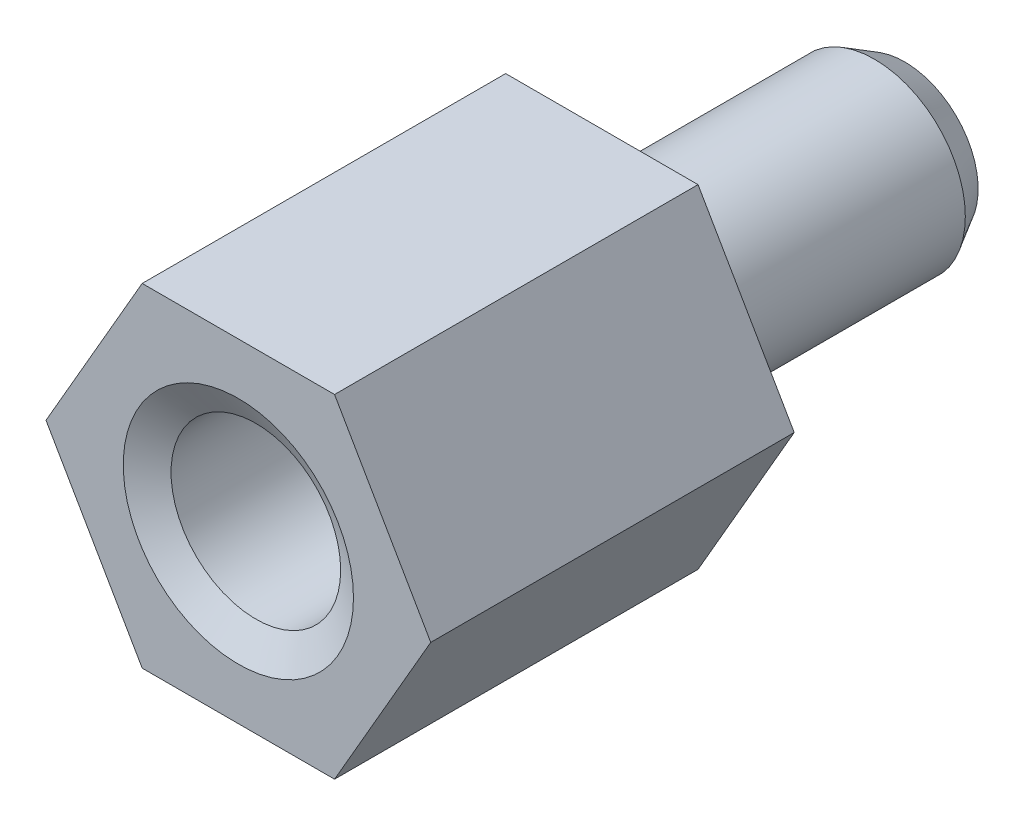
ISO-10303-21;
HEADER;
FILE_DESCRIPTION(('STEP AP214'),'2;1');
FILE_NAME('part.step','',(''),(''),'','','');
FILE_SCHEMA(('AUTOMOTIVE_DESIGN { 1 0 10303 214 1 1 1 1 }'));
ENDSEC;
DATA;
#1=APPLICATION_CONTEXT('core data for automotive mechanical design processes');
#2=APPLICATION_PROTOCOL_DEFINITION('international standard','automotive_design',2000,#1);
#3=PRODUCT_CONTEXT('',#1,'mechanical');
#4=PRODUCT('Part','Part','',(#3));
#5=PRODUCT_RELATED_PRODUCT_CATEGORY('part','',(#4));
#6=PRODUCT_DEFINITION_FORMATION('','',#4);
#7=PRODUCT_DEFINITION_CONTEXT('part definition',#1,'design');
#8=PRODUCT_DEFINITION('design','',#6,#7);
#9=PRODUCT_DEFINITION_SHAPE('','',#8);
#10=(LENGTH_UNIT() NAMED_UNIT(*) SI_UNIT(.MILLI.,.METRE.));
#11=(NAMED_UNIT(*) PLANE_ANGLE_UNIT() SI_UNIT($,.RADIAN.));
#12=(NAMED_UNIT(*) SI_UNIT($,.STERADIAN.) SOLID_ANGLE_UNIT());
#13=UNCERTAINTY_MEASURE_WITH_UNIT(LENGTH_MEASURE(1.E-05),#10,'distance_accuracy_value','');
#14=(GEOMETRIC_REPRESENTATION_CONTEXT(3) GLOBAL_UNCERTAINTY_ASSIGNED_CONTEXT((#13)) GLOBAL_UNIT_ASSIGNED_CONTEXT((#10,
#11,#12)) REPRESENTATION_CONTEXT('',''));
#15=CARTESIAN_POINT('',(0.,0.,0.));
#16=DIRECTION('',(0.,0.,1.));
#17=DIRECTION('',(1.,0.,0.));
#18=AXIS2_PLACEMENT_3D('',#15,#16,#17);
#19=CARTESIAN_POINT('',(3.17542648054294,0.,6.));
#20=DIRECTION('',(-0.866025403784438,-0.5,0.));
#21=DIRECTION('',(0.5,-0.866025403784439,0.));
#22=AXIS2_PLACEMENT_3D('',#19,#20,#21);
#23=PLANE('',#22);
#24=DIRECTION('',(-0.5,0.866025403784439,0.));
#25=VECTOR('',#24,1.);
#26=CARTESIAN_POINT('',(3.17542648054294,0.,0.));
#27=LINE('',#26,#25);
#28=CARTESIAN_POINT('',(3.17542648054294,0.,0.));
#29=VERTEX_POINT('',#28);
#30=CARTESIAN_POINT('',(1.58771324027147,2.75,0.));
#31=VERTEX_POINT('',#30);
#32=EDGE_CURVE('E132',#29,#31,#27,.T.);
#33=ORIENTED_EDGE('',*,*,#32,.T.);
#34=DIRECTION('',(0.,0.,-1.));
#35=VECTOR('',#34,1.);
#36=CARTESIAN_POINT('',(1.58771324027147,2.75,6.));
#37=LINE('',#36,#35);
#38=CARTESIAN_POINT('',(1.58771324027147,2.75,6.));
#39=VERTEX_POINT('',#38);
#40=EDGE_CURVE('E149',#39,#31,#37,.T.);
#41=ORIENTED_EDGE('',*,*,#40,.F.);
#42=DIRECTION('',(-0.5,0.866025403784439,0.));
#43=VECTOR('',#42,1.);
#44=CARTESIAN_POINT('',(3.17542648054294,0.,6.));
#45=LINE('',#44,#43);
#46=CARTESIAN_POINT('',(3.17542648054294,0.,6.));
#47=VERTEX_POINT('',#46);
#48=EDGE_CURVE('E142',#47,#39,#45,.T.);
#49=ORIENTED_EDGE('',*,*,#48,.F.);
#50=DIRECTION('',(0.,0.,-1.));
#51=VECTOR('',#50,1.);
#52=CARTESIAN_POINT('',(3.17542648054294,0.,6.));
#53=LINE('',#52,#51);
#54=EDGE_CURVE('E128',#47,#29,#53,.T.);
#55=ORIENTED_EDGE('',*,*,#54,.T.);
#56=EDGE_LOOP('',(#33,#41,#49,#55));
#57=FACE_BOUND('',#56,.T.);
#58=ADVANCED_FACE('F46',(#57),#23,.F.);
#59=CARTESIAN_POINT('',(1.58771324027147,2.75,6.));
#60=DIRECTION('',(0.,-1.,0.));
#61=DIRECTION('',(0.,0.,-1.));
#62=AXIS2_PLACEMENT_3D('',#59,#60,#61);
#63=PLANE('',#62);
#64=DIRECTION('',(-1.,0.,0.));
#65=VECTOR('',#64,1.);
#66=CARTESIAN_POINT('',(1.58771324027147,2.75,0.));
#67=LINE('',#66,#65);
#68=CARTESIAN_POINT('',(-1.58771324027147,2.75,0.));
#69=VERTEX_POINT('',#68);
#70=EDGE_CURVE('E135',#31,#69,#67,.T.);
#71=ORIENTED_EDGE('',*,*,#70,.T.);
#72=DIRECTION('',(0.,0.,-1.));
#73=VECTOR('',#72,1.);
#74=CARTESIAN_POINT('',(-1.58771324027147,2.75,6.));
#75=LINE('',#74,#73);
#76=CARTESIAN_POINT('',(-1.58771324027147,2.75,6.));
#77=VERTEX_POINT('',#76);
#78=EDGE_CURVE('E146',#77,#69,#75,.T.);
#79=ORIENTED_EDGE('',*,*,#78,.F.);
#80=DIRECTION('',(-1.,0.,0.));
#81=VECTOR('',#80,1.);
#82=CARTESIAN_POINT('',(1.58771324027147,2.75,6.));
#83=LINE('',#82,#81);
#84=EDGE_CURVE('E101',#39,#77,#83,.T.);
#85=ORIENTED_EDGE('',*,*,#84,.F.);
#86=ORIENTED_EDGE('',*,*,#40,.T.);
#87=EDGE_LOOP('',(#71,#79,#85,#86));
#88=FACE_BOUND('',#87,.T.);
#89=ADVANCED_FACE('F179',(#88),#63,.F.);
#90=CARTESIAN_POINT('',(-1.58771324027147,2.75,6.));
#91=DIRECTION('',(0.866025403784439,-0.5,0.));
#92=DIRECTION('',(0.5,0.866025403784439,0.));
#93=AXIS2_PLACEMENT_3D('',#90,#91,#92);
#94=PLANE('',#93);
#95=DIRECTION('',(-0.5,-0.866025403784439,0.));
#96=VECTOR('',#95,1.);
#97=CARTESIAN_POINT('',(-1.58771324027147,2.75,0.));
#98=LINE('',#97,#96);
#99=CARTESIAN_POINT('',(-3.17542648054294,0.,0.));
#100=VERTEX_POINT('',#99);
#101=EDGE_CURVE('E137',#69,#100,#98,.T.);
#102=ORIENTED_EDGE('',*,*,#101,.T.);
#103=DIRECTION('',(0.,0.,-1.));
#104=VECTOR('',#103,1.);
#105=CARTESIAN_POINT('',(-3.17542648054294,0.,6.));
#106=LINE('',#105,#104);
#107=CARTESIAN_POINT('',(-3.17542648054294,0.,6.));
#108=VERTEX_POINT('',#107);
#109=EDGE_CURVE('E123',#108,#100,#106,.T.);
#110=ORIENTED_EDGE('',*,*,#109,.F.);
#111=DIRECTION('',(-0.5,-0.866025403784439,0.));
#112=VECTOR('',#111,1.);
#113=CARTESIAN_POINT('',(-1.58771324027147,2.75,6.));
#114=LINE('',#113,#112);
#115=EDGE_CURVE('E114',#77,#108,#114,.T.);
#116=ORIENTED_EDGE('',*,*,#115,.F.);
#117=ORIENTED_EDGE('',*,*,#78,.T.);
#118=EDGE_LOOP('',(#102,#110,#116,#117));
#119=FACE_BOUND('',#118,.T.);
#120=ADVANCED_FACE('F185',(#119),#94,.F.);
#121=CARTESIAN_POINT('',(-3.17542648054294,0.,6.));
#122=DIRECTION('',(0.866025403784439,0.5,0.));
#123=DIRECTION('',(-0.5,0.866025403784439,0.));
#124=AXIS2_PLACEMENT_3D('',#121,#122,#123);
#125=PLANE('',#124);
#126=DIRECTION('',(0.5,-0.866025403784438,0.));
#127=VECTOR('',#126,1.);
#128=CARTESIAN_POINT('',(-3.17542648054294,0.,0.));
#129=LINE('',#128,#127);
#130=CARTESIAN_POINT('',(-1.58771324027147,-2.75,0.));
#131=VERTEX_POINT('',#130);
#132=EDGE_CURVE('E122',#100,#131,#129,.T.);
#133=ORIENTED_EDGE('',*,*,#132,.T.);
#134=DIRECTION('',(0.,0.,-1.));
#135=VECTOR('',#134,1.);
#136=CARTESIAN_POINT('',(-1.58771324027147,-2.75,6.));
#137=LINE('',#136,#135);
#138=CARTESIAN_POINT('',(-1.58771324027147,-2.75,6.));
#139=VERTEX_POINT('',#138);
#140=EDGE_CURVE('E119',#139,#131,#137,.T.);
#141=ORIENTED_EDGE('',*,*,#140,.F.);
#142=DIRECTION('',(0.5,-0.866025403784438,0.));
#143=VECTOR('',#142,1.);
#144=CARTESIAN_POINT('',(-3.17542648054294,0.,6.));
#145=LINE('',#144,#143);
#146=EDGE_CURVE('E108',#108,#139,#145,.T.);
#147=ORIENTED_EDGE('',*,*,#146,.F.);
#148=ORIENTED_EDGE('',*,*,#109,.T.);
#149=EDGE_LOOP('',(#133,#141,#147,#148));
#150=FACE_BOUND('',#149,.T.);
#151=ADVANCED_FACE('F120',(#150),#125,.F.);
#152=CARTESIAN_POINT('',(-1.58771324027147,-2.75,6.));
#153=DIRECTION('',(0.,1.,0.));
#154=DIRECTION('',(-1.,0.,0.));
#155=AXIS2_PLACEMENT_3D('',#152,#153,#154);
#156=PLANE('',#155);
#157=DIRECTION('',(1.,0.,0.));
#158=VECTOR('',#157,1.);
#159=CARTESIAN_POINT('',(-1.58771324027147,-2.75,0.));
#160=LINE('',#159,#158);
#161=CARTESIAN_POINT('',(1.58771324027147,-2.75,0.));
#162=VERTEX_POINT('',#161);
#163=EDGE_CURVE('E86',#131,#162,#160,.T.);
#164=ORIENTED_EDGE('',*,*,#163,.T.);
#165=DIRECTION('',(0.,0.,-1.));
#166=VECTOR('',#165,1.);
#167=CARTESIAN_POINT('',(1.58771324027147,-2.75,6.));
#168=LINE('',#167,#166);
#169=CARTESIAN_POINT('',(1.58771324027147,-2.75,6.));
#170=VERTEX_POINT('',#169);
#171=EDGE_CURVE('E124',#170,#162,#168,.T.);
#172=ORIENTED_EDGE('',*,*,#171,.F.);
#173=DIRECTION('',(1.,0.,0.));
#174=VECTOR('',#173,1.);
#175=CARTESIAN_POINT('',(-1.58771324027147,-2.75,6.));
#176=LINE('',#175,#174);
#177=EDGE_CURVE('E112',#139,#170,#176,.T.);
#178=ORIENTED_EDGE('',*,*,#177,.F.);
#179=ORIENTED_EDGE('',*,*,#140,.T.);
#180=EDGE_LOOP('',(#164,#172,#178,#179));
#181=FACE_BOUND('',#180,.T.);
#182=ADVANCED_FACE('F126',(#181),#156,.F.);
#183=CARTESIAN_POINT('',(1.58771324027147,-2.75,6.));
#184=DIRECTION('',(-0.866025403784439,0.5,0.));
#185=DIRECTION('',(-0.5,-0.866025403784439,0.));
#186=AXIS2_PLACEMENT_3D('',#183,#184,#185);
#187=PLANE('',#186);
#188=DIRECTION('',(0.5,0.866025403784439,0.));
#189=VECTOR('',#188,1.);
#190=CARTESIAN_POINT('',(1.58771324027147,-2.75,0.));
#191=LINE('',#190,#189);
#192=EDGE_CURVE('E92',#162,#29,#191,.T.);
#193=ORIENTED_EDGE('',*,*,#192,.T.);
#194=ORIENTED_EDGE('',*,*,#54,.F.);
#195=DIRECTION('',(0.5,0.866025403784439,0.));
#196=VECTOR('',#195,1.);
#197=CARTESIAN_POINT('',(1.58771324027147,-2.75,6.));
#198=LINE('',#197,#196);
#199=EDGE_CURVE('E63',#170,#47,#198,.T.);
#200=ORIENTED_EDGE('',*,*,#199,.F.);
#201=ORIENTED_EDGE('',*,*,#171,.T.);
#202=EDGE_LOOP('',(#193,#194,#200,#201));
#203=FACE_BOUND('',#202,.T.);
#204=ADVANCED_FACE('F221',(#203),#187,.F.);
#205=CARTESIAN_POINT('',(0.,0.,6.));
#206=DIRECTION('',(0.,0.,1.));
#207=DIRECTION('',(1.,0.,0.));
#208=AXIS2_PLACEMENT_3D('',#205,#206,#207);
#209=PLANE('',#208);
#210=CARTESIAN_POINT('',(0.,0.,6.));
#211=DIRECTION('',(0.,0.,1.));
#212=DIRECTION('',(1.,0.,0.));
#213=AXIS2_PLACEMENT_3D('',#210,#211,#212);
#214=CIRCLE('',#213,1.90000000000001);
#215=CARTESIAN_POINT('',(1.90000000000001,0.,6.));
#216=VERTEX_POINT('',#215);
#217=EDGE_CURVE('E13',#216,#216,#214,.F.);
#218=ORIENTED_EDGE('',*,*,#217,.T.);
#219=EDGE_LOOP('',(#218));
#220=FACE_BOUND('',#219,.T.);
#221=ORIENTED_EDGE('',*,*,#48,.T.);
#222=ORIENTED_EDGE('',*,*,#84,.T.);
#223=ORIENTED_EDGE('',*,*,#115,.T.);
#224=ORIENTED_EDGE('',*,*,#146,.T.);
#225=ORIENTED_EDGE('',*,*,#177,.T.);
#226=ORIENTED_EDGE('',*,*,#199,.T.);
#227=EDGE_LOOP('',(#221,#222,#223,#224,#225,#226));
#228=FACE_BOUND('',#227,.T.);
#229=ADVANCED_FACE('F110',(#220,#228),#209,.T.);
#230=CARTESIAN_POINT('',(0.,0.,0.));
#231=DIRECTION('',(0.,0.,1.));
#232=DIRECTION('',(1.,0.,0.));
#233=AXIS2_PLACEMENT_3D('',#230,#231,#232);
#234=PLANE('',#233);
#235=CARTESIAN_POINT('',(0.,0.,0.));
#236=DIRECTION('',(0.,0.,-1.));
#237=DIRECTION('',(-1.,0.,0.));
#238=AXIS2_PLACEMENT_3D('',#235,#236,#237);
#239=CIRCLE('',#238,1.5);
#240=CARTESIAN_POINT('',(-1.5,0.,0.));
#241=VERTEX_POINT('',#240);
#242=EDGE_CURVE('E151',#241,#241,#239,.T.);
#243=ORIENTED_EDGE('',*,*,#242,.F.);
#244=EDGE_LOOP('',(#243));
#245=FACE_BOUND('',#244,.T.);
#246=ORIENTED_EDGE('',*,*,#32,.F.);
#247=ORIENTED_EDGE('',*,*,#192,.F.);
#248=ORIENTED_EDGE('',*,*,#163,.F.);
#249=ORIENTED_EDGE('',*,*,#132,.F.);
#250=ORIENTED_EDGE('',*,*,#101,.F.);
#251=ORIENTED_EDGE('',*,*,#70,.F.);
#252=EDGE_LOOP('',(#246,#247,#248,#249,#250,#251));
#253=FACE_BOUND('',#252,.T.);
#254=ADVANCED_FACE('F207',(#245,#253),#234,.F.);
#255=CARTESIAN_POINT('',(0.,0.,-5.));
#256=DIRECTION('',(0.,0.,1.));
#257=DIRECTION('',(1.,0.,0.));
#258=AXIS2_PLACEMENT_3D('',#255,#256,#257);
#259=CYLINDRICAL_SURFACE('',#258,1.5);
#260=CARTESIAN_POINT('',(0.,0.,-4.5));
#261=DIRECTION('',(0.,0.,-1.));
#262=DIRECTION('',(-1.,0.,0.));
#263=AXIS2_PLACEMENT_3D('',#260,#261,#262);
#264=CIRCLE('',#263,1.5);
#265=CARTESIAN_POINT('',(-1.5,0.,-4.5));
#266=VERTEX_POINT('',#265);
#267=EDGE_CURVE('E155',#266,#266,#264,.F.);
#268=ORIENTED_EDGE('',*,*,#267,.T.);
#269=EDGE_LOOP('',(#268));
#270=FACE_BOUND('',#269,.T.);
#271=ORIENTED_EDGE('',*,*,#242,.T.);
#272=EDGE_LOOP('',(#271));
#273=FACE_BOUND('',#272,.T.);
#274=ADVANCED_FACE('F198',(#270,#273),#259,.T.);
#275=CARTESIAN_POINT('',(0.,0.,-5.));
#276=DIRECTION('',(0.,0.,-1.));
#277=DIRECTION('',(-1.,0.,0.));
#278=AXIS2_PLACEMENT_3D('',#275,#276,#277);
#279=PLANE('',#278);
#280=CARTESIAN_POINT('',(0.,0.,-5.));
#281=DIRECTION('',(0.,0.,-1.));
#282=DIRECTION('',(-1.,0.,0.));
#283=AXIS2_PLACEMENT_3D('',#280,#281,#282);
#284=CIRCLE('',#283,1.21132486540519);
#285=CARTESIAN_POINT('',(-1.21132486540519,0.,-5.));
#286=VERTEX_POINT('',#285);
#287=EDGE_CURVE('E152',#286,#286,#284,.T.);
#288=ORIENTED_EDGE('',*,*,#287,.T.);
#289=EDGE_LOOP('',(#288));
#290=FACE_BOUND('',#289,.T.);
#291=ADVANCED_FACE('F191',(#290),#279,.T.);
#292=CARTESIAN_POINT('',(0.,0.,-5.));
#293=DIRECTION('',(0.,0.,1.));
#294=DIRECTION('',(1.,0.,0.));
#295=AXIS2_PLACEMENT_3D('',#292,#293,#294);
#296=CONICAL_SURFACE('',#295,1.21132486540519,0.523598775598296);
#297=ORIENTED_EDGE('',*,*,#267,.F.);
#298=EDGE_LOOP('',(#297));
#299=FACE_BOUND('',#298,.T.);
#300=ORIENTED_EDGE('',*,*,#287,.F.);
#301=EDGE_LOOP('',(#300));
#302=FACE_BOUND('',#301,.T.);
#303=ADVANCED_FACE('F189',(#299,#302),#296,.T.);
#304=CARTESIAN_POINT('',(0.,0.,2.5));
#305=DIRECTION('',(0.,0.,1.));
#306=DIRECTION('',(1.,0.,0.));
#307=AXIS2_PLACEMENT_3D('',#304,#305,#306);
#308=CYLINDRICAL_SURFACE('',#307,1.4);
#309=CARTESIAN_POINT('',(0.,0.,5.71132486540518));
#310=DIRECTION('',(0.,0.,1.));
#311=DIRECTION('',(1.,0.,0.));
#312=AXIS2_PLACEMENT_3D('',#309,#310,#311);
#313=CIRCLE('',#312,1.4);
#314=CARTESIAN_POINT('',(1.4,0.,5.71132486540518));
#315=VERTEX_POINT('',#314);
#316=EDGE_CURVE('E55',#315,#315,#313,.T.);
#317=ORIENTED_EDGE('',*,*,#316,.T.);
#318=EDGE_LOOP('',(#317));
#319=FACE_BOUND('',#318,.T.);
#320=CARTESIAN_POINT('',(0.,0.,3.19282032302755));
#321=DIRECTION('',(0.,0.,1.));
#322=DIRECTION('',(1.,0.,0.));
#323=AXIS2_PLACEMENT_3D('',#320,#321,#322);
#324=CIRCLE('',#323,1.4);
#325=CARTESIAN_POINT('',(1.4,0.,3.19282032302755));
#326=VERTEX_POINT('',#325);
#327=EDGE_CURVE('E161',#326,#326,#324,.F.);
#328=ORIENTED_EDGE('',*,*,#327,.T.);
#329=EDGE_LOOP('',(#328));
#330=FACE_BOUND('',#329,.T.);
#331=ADVANCED_FACE('F166',(#319,#330),#308,.F.);
#332=CARTESIAN_POINT('',(0.,0.,2.5));
#333=DIRECTION('',(0.,0.,1.));
#334=DIRECTION('',(1.,0.,0.));
#335=AXIS2_PLACEMENT_3D('',#332,#333,#334);
#336=PLANE('',#335);
#337=CARTESIAN_POINT('',(0.,0.,2.5));
#338=DIRECTION('',(0.,0.,1.));
#339=DIRECTION('',(1.,0.,0.));
#340=AXIS2_PLACEMENT_3D('',#337,#338,#339);
#341=CIRCLE('',#340,0.200000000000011);
#342=CARTESIAN_POINT('',(0.200000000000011,0.,2.5));
#343=VERTEX_POINT('',#342);
#344=EDGE_CURVE('E158',#343,#343,#341,.T.);
#345=ORIENTED_EDGE('',*,*,#344,.T.);
#346=EDGE_LOOP('',(#345));
#347=FACE_BOUND('',#346,.T.);
#348=ADVANCED_FACE('F175',(#347),#336,.T.);
#349=CARTESIAN_POINT('',(0.,0.,2.5));
#350=DIRECTION('',(0.,0.,1.));
#351=DIRECTION('',(1.,0.,0.));
#352=AXIS2_PLACEMENT_3D('',#349,#350,#351);
#353=CONICAL_SURFACE('',#352,0.200000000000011,1.04719755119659);
#354=CARTESIAN_POINT('',(1.4,0.,3.19282032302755));
#355=CARTESIAN_POINT('',(1.3875,0.,3.18560344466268));
#356=CARTESIAN_POINT('',(1.375,0.,3.17838656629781));
#357=CARTESIAN_POINT('',(1.35,0.,3.16395280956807));
#358=CARTESIAN_POINT('',(1.3375,0.,3.1567359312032));
#359=CARTESIAN_POINT('',(1.3125,0.,3.14230217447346));
#360=CARTESIAN_POINT('',(1.3,0.,3.13508529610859));
#361=CARTESIAN_POINT('',(1.275,0.,3.12065153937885));
#362=CARTESIAN_POINT('',(1.2625,0.,3.11343466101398));
#363=CARTESIAN_POINT('',(1.2375,0.,3.09900090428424));
#364=CARTESIAN_POINT('',(1.225,0.,3.09178402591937));
#365=CARTESIAN_POINT('',(1.2,0.,3.07735026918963));
#366=CARTESIAN_POINT('',(1.1875,0.,3.07013339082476));
#367=CARTESIAN_POINT('',(1.1625,0.,3.05569963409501));
#368=CARTESIAN_POINT('',(1.15,0.,3.04848275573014));
#369=CARTESIAN_POINT('',(1.125,0.,3.0340489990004));
#370=CARTESIAN_POINT('',(1.1125,0.,3.02683212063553));
#371=CARTESIAN_POINT('',(1.0875,0.,3.01239836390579));
#372=CARTESIAN_POINT('',(1.075,0.,3.00518148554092));
#373=CARTESIAN_POINT('',(1.05,0.,2.99074772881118));
#374=CARTESIAN_POINT('',(1.0375,0.,2.98353085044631));
#375=CARTESIAN_POINT('',(1.0125,0.,2.96909709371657));
#376=CARTESIAN_POINT('',(1.,0.,2.9618802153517));
#377=CARTESIAN_POINT('',(0.975000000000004,0.,2.94744645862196));
#378=CARTESIAN_POINT('',(0.962500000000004,0.,2.94022958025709));
#379=CARTESIAN_POINT('',(0.937500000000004,0.,2.92579582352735));
#380=CARTESIAN_POINT('',(0.925000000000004,0.,2.91857894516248));
#381=CARTESIAN_POINT('',(0.900000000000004,0.,2.90414518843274));
#382=CARTESIAN_POINT('',(0.887500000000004,0.,2.89692831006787));
#383=CARTESIAN_POINT('',(0.862500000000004,0.,2.88249455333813));
#384=CARTESIAN_POINT('',(0.850000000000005,0.,2.87527767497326));
#385=CARTESIAN_POINT('',(0.825000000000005,0.,2.86084391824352));
#386=CARTESIAN_POINT('',(0.812500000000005,0.,2.85362703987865));
#387=CARTESIAN_POINT('',(0.787500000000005,0.,2.8391932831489));
#388=CARTESIAN_POINT('',(0.775000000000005,0.,2.83197640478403));
#389=CARTESIAN_POINT('',(0.750000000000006,0.,2.81754264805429));
#390=CARTESIAN_POINT('',(0.737500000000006,0.,2.81032576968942));
#391=CARTESIAN_POINT('',(0.712500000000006,0.,2.79589201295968));
#392=CARTESIAN_POINT('',(0.700000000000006,0.,2.78867513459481));
#393=CARTESIAN_POINT('',(0.675000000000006,0.,2.77424137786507));
#394=CARTESIAN_POINT('',(0.662500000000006,0.,2.7670244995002));
#395=CARTESIAN_POINT('',(0.637500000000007,0.,2.75259074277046));
#396=CARTESIAN_POINT('',(0.625000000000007,0.,2.74537386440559));
#397=CARTESIAN_POINT('',(0.600000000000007,0.,2.73094010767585));
#398=CARTESIAN_POINT('',(0.587500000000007,0.,2.72372322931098));
#399=CARTESIAN_POINT('',(0.562500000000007,0.,2.70928947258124));
#400=CARTESIAN_POINT('',(0.550000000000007,0.,2.70207259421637));
#401=CARTESIAN_POINT('',(0.525000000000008,0.,2.68763883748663));
#402=CARTESIAN_POINT('',(0.512500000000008,0.,2.68042195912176));
#403=CARTESIAN_POINT('',(0.487500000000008,0.,2.66598820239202));
#404=CARTESIAN_POINT('',(0.475000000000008,0.,2.65877132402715));
#405=CARTESIAN_POINT('',(0.450000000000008,0.,2.64433756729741));
#406=CARTESIAN_POINT('',(0.437500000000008,0.,2.63712068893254));
#407=CARTESIAN_POINT('',(0.412500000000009,0.,2.6226869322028));
#408=CARTESIAN_POINT('',(0.400000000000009,0.,2.61547005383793));
#409=CARTESIAN_POINT('',(0.375000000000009,0.,2.60103629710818));
#410=CARTESIAN_POINT('',(0.362500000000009,0.,2.59381941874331));
#411=CARTESIAN_POINT('',(0.337500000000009,0.,2.57938566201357));
#412=CARTESIAN_POINT('',(0.325000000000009,0.,2.5721687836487));
#413=CARTESIAN_POINT('',(0.30000000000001,0.,2.55773502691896));
#414=CARTESIAN_POINT('',(0.28750000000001,0.,2.55051814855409));
#415=CARTESIAN_POINT('',(0.26250000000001,0.,2.53608439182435));
#416=CARTESIAN_POINT('',(0.25000000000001,0.,2.52886751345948));
#417=CARTESIAN_POINT('',(0.22500000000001,0.,2.51443375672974));
#418=CARTESIAN_POINT('',(0.21250000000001,0.,2.50721687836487));
#419=CARTESIAN_POINT('',(0.200000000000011,0.,2.5));
#420=B_SPLINE_CURVE_WITH_KNOTS('',3,(#354,#355,#356,#357,#358,#359,#360,#361,#362,#363,#364,
#365,#366,#367,#368,#369,#370,#371,#372,#373,#374,#375,#376,#377,#378,#379,#380,#381,#382,#383,
#384,#385,#386,#387,#388,#389,#390,#391,#392,#393,#394,#395,#396,#397,#398,#399,#400,#401,#402,
#403,#404,#405,#406,#407,#408,#409,#410,#411,#412,#413,#414,#415,#416,#417,#418,#419),
.UNSPECIFIED.,.F.,.F.,(4,2,2,2,2,2,2,2,2,2,2,2,2,2,2,2,2,2,2,2,2,2,2,2,2,2,2,2,2,2,2,2,4),(0.,
0.0433012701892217,0.0866025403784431,0.129903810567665,0.173205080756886,0.216506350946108,
0.25980762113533,0.303108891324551,0.346410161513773,0.389711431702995,0.433012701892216,
0.476313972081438,0.51961524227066,0.562916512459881,0.606217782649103,0.649519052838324,
0.692820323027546,0.736121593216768,0.779422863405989,0.822724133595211,0.866025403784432,
0.909326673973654,0.952627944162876,0.995929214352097,1.03923048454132,1.08253175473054,
1.12583302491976,1.16913429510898,1.21243556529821,1.25573683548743,1.29903810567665,
1.34233937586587,1.38564064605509),.UNSPECIFIED.);
#421=EDGE_CURVE('BSEAM170',#326,#343,#420,.T.);
#422=ORIENTED_EDGE('',*,*,#327,.F.);
#423=ORIENTED_EDGE('',*,*,#344,.F.);
#424=ORIENTED_EDGE('',*,*,#421,.T.);
#425=ORIENTED_EDGE('',*,*,#421,.F.);
#426=EDGE_LOOP('',(#422,#424,#423,#425));
#427=FACE_BOUND('',#426,.T.);
#428=ADVANCED_FACE('F170',(#427),#353,.F.);
#429=CARTESIAN_POINT('',(0.,0.,5.71132486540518));
#430=DIRECTION('',(0.,0.,1.));
#431=DIRECTION('',(1.,0.,0.));
#432=AXIS2_PLACEMENT_3D('',#429,#430,#431);
#433=CONICAL_SURFACE('',#432,1.4,1.0471975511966);
#434=ORIENTED_EDGE('',*,*,#217,.F.);
#435=EDGE_LOOP('',(#434));
#436=FACE_BOUND('',#435,.T.);
#437=ORIENTED_EDGE('',*,*,#316,.F.);
#438=EDGE_LOOP('',(#437));
#439=FACE_BOUND('',#438,.T.);
#440=ADVANCED_FACE('F48',(#436,#439),#433,.F.);
#441=CLOSED_SHELL('',(#58,#89,#120,#151,#182,#204,#229,#254,#274,#291,#303,#331,#348,#428,#440));
#442=MANIFOLD_SOLID_BREP('B2',#441);
#443=ADVANCED_BREP_SHAPE_REPRESENTATION('',(#18,#442),#14);
#444=SHAPE_DEFINITION_REPRESENTATION(#9,#443);
ENDSEC;
END-ISO-10303-21;
